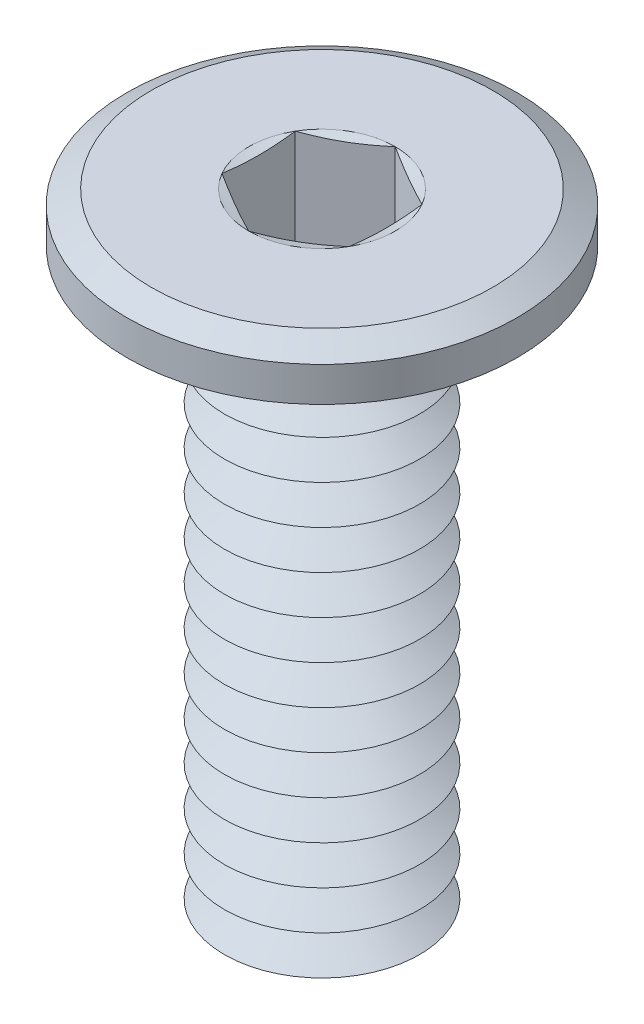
ISO-10303-21;
HEADER;
FILE_DESCRIPTION(('STEP AP214'),'2;1');
FILE_NAME('part.step','',(''),(''),'','','');
FILE_SCHEMA(('AUTOMOTIVE_DESIGN { 1 0 10303 214 1 1 1 1 }'));
ENDSEC;
DATA;
#1=APPLICATION_CONTEXT('core data for automotive mechanical design processes');
#2=APPLICATION_PROTOCOL_DEFINITION('international standard','automotive_design',2000,#1);
#3=PRODUCT_CONTEXT('',#1,'mechanical');
#4=PRODUCT('Part','Part','',(#3));
#5=PRODUCT_RELATED_PRODUCT_CATEGORY('part','',(#4));
#6=PRODUCT_DEFINITION_FORMATION('','',#4);
#7=PRODUCT_DEFINITION_CONTEXT('part definition',#1,'design');
#8=PRODUCT_DEFINITION('design','',#6,#7);
#9=PRODUCT_DEFINITION_SHAPE('','',#8);
#10=(LENGTH_UNIT() NAMED_UNIT(*) SI_UNIT(.MILLI.,.METRE.));
#11=(NAMED_UNIT(*) PLANE_ANGLE_UNIT() SI_UNIT($,.RADIAN.));
#12=(NAMED_UNIT(*) SI_UNIT($,.STERADIAN.) SOLID_ANGLE_UNIT());
#13=UNCERTAINTY_MEASURE_WITH_UNIT(LENGTH_MEASURE(1.E-05),#10,'distance_accuracy_value','');
#14=(GEOMETRIC_REPRESENTATION_CONTEXT(3) GLOBAL_UNCERTAINTY_ASSIGNED_CONTEXT((#13)) GLOBAL_UNIT_ASSIGNED_CONTEXT((#10,
#11,#12)) REPRESENTATION_CONTEXT('',''));
#15=CARTESIAN_POINT('',(0.,0.,0.));
#16=DIRECTION('',(0.,0.,1.));
#17=DIRECTION('',(1.,0.,0.));
#18=AXIS2_PLACEMENT_3D('',#15,#16,#17);
#19=CARTESIAN_POINT('',(0.,-5.9,0.));
#20=DIRECTION('',(0.,-1.,0.));
#21=DIRECTION('',(0.,0.,-1.));
#22=AXIS2_PLACEMENT_3D('',#19,#20,#21);
#23=CONICAL_SURFACE('',#22,1.,1.0471975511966);
#24=CARTESIAN_POINT('',(0.,-5.7,0.));
#25=DIRECTION('',(0.,1.,0.));
#26=DIRECTION('',(0.,0.,1.));
#27=AXIS2_PLACEMENT_3D('',#24,#25,#26);
#28=CIRCLE('',#27,0.653589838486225);
#29=CARTESIAN_POINT('',(0.,-5.7,0.653589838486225));
#30=VERTEX_POINT('',#29);
#31=EDGE_CURVE('E402',#30,#30,#28,.T.);
#32=ORIENTED_EDGE('',*,*,#31,.F.);
#33=EDGE_LOOP('',(#32));
#34=FACE_BOUND('',#33,.T.);
#35=CARTESIAN_POINT('',(0.,-5.9,0.));
#36=DIRECTION('',(0.,1.,0.));
#37=DIRECTION('',(0.,0.,1.));
#38=AXIS2_PLACEMENT_3D('',#35,#36,#37);
#39=CIRCLE('',#38,1.);
#40=CARTESIAN_POINT('',(0.,-5.9,1.));
#41=VERTEX_POINT('',#40);
#42=EDGE_CURVE('E405',#41,#41,#39,.T.);
#43=ORIENTED_EDGE('',*,*,#42,.T.);
#44=EDGE_LOOP('',(#43));
#45=FACE_BOUND('',#44,.T.);
#46=ADVANCED_FACE('F32',(#34,#45),#23,.T.);
#47=CARTESIAN_POINT('',(0.,-5.7,0.));
#48=DIRECTION('',(0.,1.,0.));
#49=DIRECTION('',(0.,0.,1.));
#50=AXIS2_PLACEMENT_3D('',#47,#48,#49);
#51=CONICAL_SURFACE('',#50,0.653589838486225,1.0471975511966);
#52=CARTESIAN_POINT('',(0.,-5.5,0.));
#53=DIRECTION('',(0.,1.,0.));
#54=DIRECTION('',(0.,0.,1.));
#55=AXIS2_PLACEMENT_3D('',#52,#53,#54);
#56=CIRCLE('',#55,1.);
#57=CARTESIAN_POINT('',(0.,-5.5,1.));
#58=VERTEX_POINT('',#57);
#59=EDGE_CURVE('E399',#58,#58,#56,.T.);
#60=ORIENTED_EDGE('',*,*,#59,.F.);
#61=EDGE_LOOP('',(#60));
#62=FACE_BOUND('',#61,.T.);
#63=ORIENTED_EDGE('',*,*,#31,.T.);
#64=EDGE_LOOP('',(#63));
#65=FACE_BOUND('',#64,.T.);
#66=ADVANCED_FACE('F215',(#62,#65),#51,.T.);
#67=CARTESIAN_POINT('',(0.,-6.5,0.));
#68=DIRECTION('',(0.,-1.,0.));
#69=DIRECTION('',(0.,0.,-1.));
#70=AXIS2_PLACEMENT_3D('',#67,#68,#69);
#71=PLANE('',#70);
#72=CARTESIAN_POINT('',(0.,-6.5,0.));
#73=DIRECTION('',(0.,1.,0.));
#74=DIRECTION('',(0.,0.,1.));
#75=AXIS2_PLACEMENT_3D('',#72,#73,#74);
#76=CIRCLE('',#75,0.653589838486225);
#77=CARTESIAN_POINT('',(0.,-6.5,0.653589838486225));
#78=VERTEX_POINT('',#77);
#79=EDGE_CURVE('E277',#78,#78,#76,.T.);
#80=ORIENTED_EDGE('',*,*,#79,.F.);
#81=EDGE_LOOP('',(#80));
#82=FACE_BOUND('',#81,.T.);
#83=ADVANCED_FACE('F221',(#82),#71,.T.);
#84=CARTESIAN_POINT('',(0.,-6.5,0.));
#85=DIRECTION('',(0.,1.,0.));
#86=DIRECTION('',(0.,0.,1.));
#87=AXIS2_PLACEMENT_3D('',#84,#85,#86);
#88=CONICAL_SURFACE('',#87,0.653589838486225,1.0471975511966);
#89=CARTESIAN_POINT('',(0.,-6.3,0.));
#90=DIRECTION('',(0.,1.,0.));
#91=DIRECTION('',(0.,0.,1.));
#92=AXIS2_PLACEMENT_3D('',#89,#90,#91);
#93=CIRCLE('',#92,1.);
#94=CARTESIAN_POINT('',(0.,-6.3,1.));
#95=VERTEX_POINT('',#94);
#96=EDGE_CURVE('E411',#95,#95,#93,.T.);
#97=ORIENTED_EDGE('',*,*,#96,.F.);
#98=EDGE_LOOP('',(#97));
#99=FACE_BOUND('',#98,.T.);
#100=ORIENTED_EDGE('',*,*,#79,.T.);
#101=EDGE_LOOP('',(#100));
#102=FACE_BOUND('',#101,.T.);
#103=ADVANCED_FACE('F236',(#99,#102),#88,.T.);
#104=CARTESIAN_POINT('',(0.,-6.3,0.));
#105=DIRECTION('',(0.,-1.,0.));
#106=DIRECTION('',(0.,0.,-1.));
#107=AXIS2_PLACEMENT_3D('',#104,#105,#106);
#108=CONICAL_SURFACE('',#107,1.,1.0471975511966);
#109=CARTESIAN_POINT('',(0.,-6.1,0.));
#110=DIRECTION('',(0.,1.,0.));
#111=DIRECTION('',(0.,0.,1.));
#112=AXIS2_PLACEMENT_3D('',#109,#110,#111);
#113=CIRCLE('',#112,0.653589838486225);
#114=CARTESIAN_POINT('',(0.,-6.1,0.653589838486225));
#115=VERTEX_POINT('',#114);
#116=EDGE_CURVE('E408',#115,#115,#113,.T.);
#117=ORIENTED_EDGE('',*,*,#116,.F.);
#118=EDGE_LOOP('',(#117));
#119=FACE_BOUND('',#118,.T.);
#120=ORIENTED_EDGE('',*,*,#96,.T.);
#121=EDGE_LOOP('',(#120));
#122=FACE_BOUND('',#121,.T.);
#123=ADVANCED_FACE('F232',(#119,#122),#108,.T.);
#124=CARTESIAN_POINT('',(0.,-6.1,0.));
#125=DIRECTION('',(0.,1.,0.));
#126=DIRECTION('',(0.,0.,1.));
#127=AXIS2_PLACEMENT_3D('',#124,#125,#126);
#128=CONICAL_SURFACE('',#127,0.653589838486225,1.0471975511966);
#129=ORIENTED_EDGE('',*,*,#42,.F.);
#130=EDGE_LOOP('',(#129));
#131=FACE_BOUND('',#130,.T.);
#132=ORIENTED_EDGE('',*,*,#116,.T.);
#133=EDGE_LOOP('',(#132));
#134=FACE_BOUND('',#133,.T.);
#135=ADVANCED_FACE('F228',(#131,#134),#128,.T.);
#136=CARTESIAN_POINT('',(0.,-5.5,0.));
#137=DIRECTION('',(0.,-1.,0.));
#138=DIRECTION('',(0.,0.,-1.));
#139=AXIS2_PLACEMENT_3D('',#136,#137,#138);
#140=CONICAL_SURFACE('',#139,1.,1.0471975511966);
#141=CARTESIAN_POINT('',(0.,-5.3,0.));
#142=DIRECTION('',(0.,1.,0.));
#143=DIRECTION('',(0.,0.,1.));
#144=AXIS2_PLACEMENT_3D('',#141,#142,#143);
#145=CIRCLE('',#144,0.653589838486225);
#146=CARTESIAN_POINT('',(0.,-5.3,0.653589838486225));
#147=VERTEX_POINT('',#146);
#148=EDGE_CURVE('E396',#147,#147,#145,.T.);
#149=ORIENTED_EDGE('',*,*,#148,.F.);
#150=EDGE_LOOP('',(#149));
#151=FACE_BOUND('',#150,.T.);
#152=ORIENTED_EDGE('',*,*,#59,.T.);
#153=EDGE_LOOP('',(#152));
#154=FACE_BOUND('',#153,.T.);
#155=ADVANCED_FACE('F231',(#151,#154),#140,.T.);
#156=CARTESIAN_POINT('',(0.,-5.3,0.));
#157=DIRECTION('',(0.,1.,0.));
#158=DIRECTION('',(0.,0.,1.));
#159=AXIS2_PLACEMENT_3D('',#156,#157,#158);
#160=CONICAL_SURFACE('',#159,0.653589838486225,1.0471975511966);
#161=CARTESIAN_POINT('',(0.,-5.1,0.));
#162=DIRECTION('',(0.,1.,0.));
#163=DIRECTION('',(0.,0.,1.));
#164=AXIS2_PLACEMENT_3D('',#161,#162,#163);
#165=CIRCLE('',#164,1.);
#166=CARTESIAN_POINT('',(0.,-5.1,1.));
#167=VERTEX_POINT('',#166);
#168=EDGE_CURVE('E393',#167,#167,#165,.T.);
#169=ORIENTED_EDGE('',*,*,#168,.F.);
#170=EDGE_LOOP('',(#169));
#171=FACE_BOUND('',#170,.T.);
#172=ORIENTED_EDGE('',*,*,#148,.T.);
#173=EDGE_LOOP('',(#172));
#174=FACE_BOUND('',#173,.T.);
#175=ADVANCED_FACE('F425',(#171,#174),#160,.T.);
#176=CARTESIAN_POINT('',(0.,-5.1,0.));
#177=DIRECTION('',(0.,-1.,0.));
#178=DIRECTION('',(0.,0.,-1.));
#179=AXIS2_PLACEMENT_3D('',#176,#177,#178);
#180=CONICAL_SURFACE('',#179,1.,1.0471975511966);
#181=CARTESIAN_POINT('',(0.,-4.9,0.));
#182=DIRECTION('',(0.,1.,0.));
#183=DIRECTION('',(0.,0.,1.));
#184=AXIS2_PLACEMENT_3D('',#181,#182,#183);
#185=CIRCLE('',#184,0.653589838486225);
#186=CARTESIAN_POINT('',(0.,-4.9,0.653589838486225));
#187=VERTEX_POINT('',#186);
#188=EDGE_CURVE('E390',#187,#187,#185,.T.);
#189=ORIENTED_EDGE('',*,*,#188,.F.);
#190=EDGE_LOOP('',(#189));
#191=FACE_BOUND('',#190,.T.);
#192=ORIENTED_EDGE('',*,*,#168,.T.);
#193=EDGE_LOOP('',(#192));
#194=FACE_BOUND('',#193,.T.);
#195=ADVANCED_FACE('F430',(#191,#194),#180,.T.);
#196=CARTESIAN_POINT('',(0.,-4.9,0.));
#197=DIRECTION('',(0.,1.,0.));
#198=DIRECTION('',(0.,0.,1.));
#199=AXIS2_PLACEMENT_3D('',#196,#197,#198);
#200=CONICAL_SURFACE('',#199,0.653589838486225,1.0471975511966);
#201=CARTESIAN_POINT('',(0.,-4.7,0.));
#202=DIRECTION('',(0.,1.,0.));
#203=DIRECTION('',(0.,0.,1.));
#204=AXIS2_PLACEMENT_3D('',#201,#202,#203);
#205=CIRCLE('',#204,1.);
#206=CARTESIAN_POINT('',(0.,-4.7,1.));
#207=VERTEX_POINT('',#206);
#208=EDGE_CURVE('E387',#207,#207,#205,.T.);
#209=ORIENTED_EDGE('',*,*,#208,.F.);
#210=EDGE_LOOP('',(#209));
#211=FACE_BOUND('',#210,.T.);
#212=ORIENTED_EDGE('',*,*,#188,.T.);
#213=EDGE_LOOP('',(#212));
#214=FACE_BOUND('',#213,.T.);
#215=ADVANCED_FACE('F437',(#211,#214),#200,.T.);
#216=CARTESIAN_POINT('',(0.,-4.7,0.));
#217=DIRECTION('',(0.,-1.,0.));
#218=DIRECTION('',(0.,0.,-1.));
#219=AXIS2_PLACEMENT_3D('',#216,#217,#218);
#220=CONICAL_SURFACE('',#219,1.,1.0471975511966);
#221=CARTESIAN_POINT('',(0.,-4.5,0.));
#222=DIRECTION('',(0.,1.,0.));
#223=DIRECTION('',(0.,0.,1.));
#224=AXIS2_PLACEMENT_3D('',#221,#222,#223);
#225=CIRCLE('',#224,0.653589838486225);
#226=CARTESIAN_POINT('',(0.,-4.5,0.653589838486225));
#227=VERTEX_POINT('',#226);
#228=EDGE_CURVE('E384',#227,#227,#225,.T.);
#229=ORIENTED_EDGE('',*,*,#228,.F.);
#230=EDGE_LOOP('',(#229));
#231=FACE_BOUND('',#230,.T.);
#232=ORIENTED_EDGE('',*,*,#208,.T.);
#233=EDGE_LOOP('',(#232));
#234=FACE_BOUND('',#233,.T.);
#235=ADVANCED_FACE('F441',(#231,#234),#220,.T.);
#236=CARTESIAN_POINT('',(0.,-4.5,0.));
#237=DIRECTION('',(0.,1.,0.));
#238=DIRECTION('',(0.,0.,1.));
#239=AXIS2_PLACEMENT_3D('',#236,#237,#238);
#240=CONICAL_SURFACE('',#239,0.653589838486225,1.0471975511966);
#241=CARTESIAN_POINT('',(0.,-4.3,0.));
#242=DIRECTION('',(0.,1.,0.));
#243=DIRECTION('',(0.,0.,1.));
#244=AXIS2_PLACEMENT_3D('',#241,#242,#243);
#245=CIRCLE('',#244,1.);
#246=CARTESIAN_POINT('',(0.,-4.3,1.));
#247=VERTEX_POINT('',#246);
#248=EDGE_CURVE('E381',#247,#247,#245,.T.);
#249=ORIENTED_EDGE('',*,*,#248,.F.);
#250=EDGE_LOOP('',(#249));
#251=FACE_BOUND('',#250,.T.);
#252=ORIENTED_EDGE('',*,*,#228,.T.);
#253=EDGE_LOOP('',(#252));
#254=FACE_BOUND('',#253,.T.);
#255=ADVANCED_FACE('F445',(#251,#254),#240,.T.);
#256=CARTESIAN_POINT('',(0.,-4.3,0.));
#257=DIRECTION('',(0.,-1.,0.));
#258=DIRECTION('',(0.,0.,-1.));
#259=AXIS2_PLACEMENT_3D('',#256,#257,#258);
#260=CONICAL_SURFACE('',#259,1.,1.0471975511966);
#261=CARTESIAN_POINT('',(0.,-4.1,0.));
#262=DIRECTION('',(0.,1.,0.));
#263=DIRECTION('',(0.,0.,1.));
#264=AXIS2_PLACEMENT_3D('',#261,#262,#263);
#265=CIRCLE('',#264,0.653589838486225);
#266=CARTESIAN_POINT('',(0.,-4.1,0.653589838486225));
#267=VERTEX_POINT('',#266);
#268=EDGE_CURVE('E378',#267,#267,#265,.T.);
#269=ORIENTED_EDGE('',*,*,#268,.F.);
#270=EDGE_LOOP('',(#269));
#271=FACE_BOUND('',#270,.T.);
#272=ORIENTED_EDGE('',*,*,#248,.T.);
#273=EDGE_LOOP('',(#272));
#274=FACE_BOUND('',#273,.T.);
#275=ADVANCED_FACE('F449',(#271,#274),#260,.T.);
#276=CARTESIAN_POINT('',(0.,-4.1,0.));
#277=DIRECTION('',(0.,1.,0.));
#278=DIRECTION('',(0.,0.,1.));
#279=AXIS2_PLACEMENT_3D('',#276,#277,#278);
#280=CONICAL_SURFACE('',#279,0.653589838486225,1.0471975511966);
#281=CARTESIAN_POINT('',(0.,-3.9,0.));
#282=DIRECTION('',(0.,1.,0.));
#283=DIRECTION('',(0.,0.,1.));
#284=AXIS2_PLACEMENT_3D('',#281,#282,#283);
#285=CIRCLE('',#284,1.);
#286=CARTESIAN_POINT('',(0.,-3.9,1.));
#287=VERTEX_POINT('',#286);
#288=EDGE_CURVE('E375',#287,#287,#285,.T.);
#289=ORIENTED_EDGE('',*,*,#288,.F.);
#290=EDGE_LOOP('',(#289));
#291=FACE_BOUND('',#290,.T.);
#292=ORIENTED_EDGE('',*,*,#268,.T.);
#293=EDGE_LOOP('',(#292));
#294=FACE_BOUND('',#293,.T.);
#295=ADVANCED_FACE('F453',(#291,#294),#280,.T.);
#296=CARTESIAN_POINT('',(0.,-3.9,0.));
#297=DIRECTION('',(0.,-1.,0.));
#298=DIRECTION('',(0.,0.,-1.));
#299=AXIS2_PLACEMENT_3D('',#296,#297,#298);
#300=CONICAL_SURFACE('',#299,1.,1.0471975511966);
#301=CARTESIAN_POINT('',(0.,-3.7,0.));
#302=DIRECTION('',(0.,1.,0.));
#303=DIRECTION('',(0.,0.,1.));
#304=AXIS2_PLACEMENT_3D('',#301,#302,#303);
#305=CIRCLE('',#304,0.653589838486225);
#306=CARTESIAN_POINT('',(0.,-3.7,0.653589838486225));
#307=VERTEX_POINT('',#306);
#308=EDGE_CURVE('E372',#307,#307,#305,.T.);
#309=ORIENTED_EDGE('',*,*,#308,.F.);
#310=EDGE_LOOP('',(#309));
#311=FACE_BOUND('',#310,.T.);
#312=ORIENTED_EDGE('',*,*,#288,.T.);
#313=EDGE_LOOP('',(#312));
#314=FACE_BOUND('',#313,.T.);
#315=ADVANCED_FACE('F457',(#311,#314),#300,.T.);
#316=CARTESIAN_POINT('',(0.,-3.7,0.));
#317=DIRECTION('',(0.,1.,0.));
#318=DIRECTION('',(0.,0.,1.));
#319=AXIS2_PLACEMENT_3D('',#316,#317,#318);
#320=CONICAL_SURFACE('',#319,0.653589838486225,1.0471975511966);
#321=CARTESIAN_POINT('',(0.,-3.5,0.));
#322=DIRECTION('',(0.,1.,0.));
#323=DIRECTION('',(0.,0.,1.));
#324=AXIS2_PLACEMENT_3D('',#321,#322,#323);
#325=CIRCLE('',#324,1.);
#326=CARTESIAN_POINT('',(0.,-3.5,1.));
#327=VERTEX_POINT('',#326);
#328=EDGE_CURVE('E369',#327,#327,#325,.T.);
#329=ORIENTED_EDGE('',*,*,#328,.F.);
#330=EDGE_LOOP('',(#329));
#331=FACE_BOUND('',#330,.T.);
#332=ORIENTED_EDGE('',*,*,#308,.T.);
#333=EDGE_LOOP('',(#332));
#334=FACE_BOUND('',#333,.T.);
#335=ADVANCED_FACE('F461',(#331,#334),#320,.T.);
#336=CARTESIAN_POINT('',(0.,-3.5,0.));
#337=DIRECTION('',(0.,-1.,0.));
#338=DIRECTION('',(0.,0.,-1.));
#339=AXIS2_PLACEMENT_3D('',#336,#337,#338);
#340=CONICAL_SURFACE('',#339,1.,1.0471975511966);
#341=CARTESIAN_POINT('',(0.,-3.3,0.));
#342=DIRECTION('',(0.,1.,0.));
#343=DIRECTION('',(0.,0.,1.));
#344=AXIS2_PLACEMENT_3D('',#341,#342,#343);
#345=CIRCLE('',#344,0.653589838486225);
#346=CARTESIAN_POINT('',(0.,-3.3,0.653589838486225));
#347=VERTEX_POINT('',#346);
#348=EDGE_CURVE('E366',#347,#347,#345,.T.);
#349=ORIENTED_EDGE('',*,*,#348,.F.);
#350=EDGE_LOOP('',(#349));
#351=FACE_BOUND('',#350,.T.);
#352=ORIENTED_EDGE('',*,*,#328,.T.);
#353=EDGE_LOOP('',(#352));
#354=FACE_BOUND('',#353,.T.);
#355=ADVANCED_FACE('F465',(#351,#354),#340,.T.);
#356=CARTESIAN_POINT('',(0.,-3.3,0.));
#357=DIRECTION('',(0.,1.,0.));
#358=DIRECTION('',(0.,0.,1.));
#359=AXIS2_PLACEMENT_3D('',#356,#357,#358);
#360=CONICAL_SURFACE('',#359,0.653589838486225,1.0471975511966);
#361=CARTESIAN_POINT('',(0.,-3.1,0.));
#362=DIRECTION('',(0.,1.,0.));
#363=DIRECTION('',(0.,0.,1.));
#364=AXIS2_PLACEMENT_3D('',#361,#362,#363);
#365=CIRCLE('',#364,1.);
#366=CARTESIAN_POINT('',(0.,-3.1,1.));
#367=VERTEX_POINT('',#366);
#368=EDGE_CURVE('E363',#367,#367,#365,.T.);
#369=ORIENTED_EDGE('',*,*,#368,.F.);
#370=EDGE_LOOP('',(#369));
#371=FACE_BOUND('',#370,.T.);
#372=ORIENTED_EDGE('',*,*,#348,.T.);
#373=EDGE_LOOP('',(#372));
#374=FACE_BOUND('',#373,.T.);
#375=ADVANCED_FACE('F469',(#371,#374),#360,.T.);
#376=CARTESIAN_POINT('',(0.,-3.1,0.));
#377=DIRECTION('',(0.,-1.,0.));
#378=DIRECTION('',(0.,0.,-1.));
#379=AXIS2_PLACEMENT_3D('',#376,#377,#378);
#380=CONICAL_SURFACE('',#379,1.,1.0471975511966);
#381=CARTESIAN_POINT('',(0.,-2.9,0.));
#382=DIRECTION('',(0.,1.,0.));
#383=DIRECTION('',(0.,0.,1.));
#384=AXIS2_PLACEMENT_3D('',#381,#382,#383);
#385=CIRCLE('',#384,0.653589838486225);
#386=CARTESIAN_POINT('',(0.,-2.9,0.653589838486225));
#387=VERTEX_POINT('',#386);
#388=EDGE_CURVE('E360',#387,#387,#385,.T.);
#389=ORIENTED_EDGE('',*,*,#388,.F.);
#390=EDGE_LOOP('',(#389));
#391=FACE_BOUND('',#390,.T.);
#392=ORIENTED_EDGE('',*,*,#368,.T.);
#393=EDGE_LOOP('',(#392));
#394=FACE_BOUND('',#393,.T.);
#395=ADVANCED_FACE('F473',(#391,#394),#380,.T.);
#396=CARTESIAN_POINT('',(0.,-2.9,0.));
#397=DIRECTION('',(0.,1.,0.));
#398=DIRECTION('',(0.,0.,1.));
#399=AXIS2_PLACEMENT_3D('',#396,#397,#398);
#400=CONICAL_SURFACE('',#399,0.653589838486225,1.0471975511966);
#401=CARTESIAN_POINT('',(0.,-2.7,0.));
#402=DIRECTION('',(0.,1.,0.));
#403=DIRECTION('',(0.,0.,1.));
#404=AXIS2_PLACEMENT_3D('',#401,#402,#403);
#405=CIRCLE('',#404,1.);
#406=CARTESIAN_POINT('',(0.,-2.7,1.));
#407=VERTEX_POINT('',#406);
#408=EDGE_CURVE('E357',#407,#407,#405,.T.);
#409=ORIENTED_EDGE('',*,*,#408,.F.);
#410=EDGE_LOOP('',(#409));
#411=FACE_BOUND('',#410,.T.);
#412=ORIENTED_EDGE('',*,*,#388,.T.);
#413=EDGE_LOOP('',(#412));
#414=FACE_BOUND('',#413,.T.);
#415=ADVANCED_FACE('F477',(#411,#414),#400,.T.);
#416=CARTESIAN_POINT('',(0.,-2.7,0.));
#417=DIRECTION('',(0.,-1.,0.));
#418=DIRECTION('',(0.,0.,-1.));
#419=AXIS2_PLACEMENT_3D('',#416,#417,#418);
#420=CONICAL_SURFACE('',#419,1.,1.0471975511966);
#421=CARTESIAN_POINT('',(0.,-2.5,0.));
#422=DIRECTION('',(0.,1.,0.));
#423=DIRECTION('',(0.,0.,1.));
#424=AXIS2_PLACEMENT_3D('',#421,#422,#423);
#425=CIRCLE('',#424,0.653589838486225);
#426=CARTESIAN_POINT('',(0.,-2.5,0.653589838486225));
#427=VERTEX_POINT('',#426);
#428=EDGE_CURVE('E354',#427,#427,#425,.T.);
#429=ORIENTED_EDGE('',*,*,#428,.F.);
#430=EDGE_LOOP('',(#429));
#431=FACE_BOUND('',#430,.T.);
#432=ORIENTED_EDGE('',*,*,#408,.T.);
#433=EDGE_LOOP('',(#432));
#434=FACE_BOUND('',#433,.T.);
#435=ADVANCED_FACE('F481',(#431,#434),#420,.T.);
#436=CARTESIAN_POINT('',(0.,-2.5,0.));
#437=DIRECTION('',(0.,1.,0.));
#438=DIRECTION('',(0.,0.,1.));
#439=AXIS2_PLACEMENT_3D('',#436,#437,#438);
#440=CONICAL_SURFACE('',#439,0.653589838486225,1.0471975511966);
#441=CARTESIAN_POINT('',(0.,-2.3,0.));
#442=DIRECTION('',(0.,1.,0.));
#443=DIRECTION('',(0.,0.,1.));
#444=AXIS2_PLACEMENT_3D('',#441,#442,#443);
#445=CIRCLE('',#444,1.);
#446=CARTESIAN_POINT('',(0.,-2.3,1.));
#447=VERTEX_POINT('',#446);
#448=EDGE_CURVE('E351',#447,#447,#445,.T.);
#449=ORIENTED_EDGE('',*,*,#448,.F.);
#450=EDGE_LOOP('',(#449));
#451=FACE_BOUND('',#450,.T.);
#452=ORIENTED_EDGE('',*,*,#428,.T.);
#453=EDGE_LOOP('',(#452));
#454=FACE_BOUND('',#453,.T.);
#455=ADVANCED_FACE('F485',(#451,#454),#440,.T.);
#456=CARTESIAN_POINT('',(0.,-2.3,0.));
#457=DIRECTION('',(0.,-1.,0.));
#458=DIRECTION('',(0.,0.,-1.));
#459=AXIS2_PLACEMENT_3D('',#456,#457,#458);
#460=CONICAL_SURFACE('',#459,1.,1.0471975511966);
#461=CARTESIAN_POINT('',(0.,-2.1,0.));
#462=DIRECTION('',(0.,1.,0.));
#463=DIRECTION('',(0.,0.,1.));
#464=AXIS2_PLACEMENT_3D('',#461,#462,#463);
#465=CIRCLE('',#464,0.653589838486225);
#466=CARTESIAN_POINT('',(0.,-2.1,0.653589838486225));
#467=VERTEX_POINT('',#466);
#468=EDGE_CURVE('E348',#467,#467,#465,.T.);
#469=ORIENTED_EDGE('',*,*,#468,.F.);
#470=EDGE_LOOP('',(#469));
#471=FACE_BOUND('',#470,.T.);
#472=ORIENTED_EDGE('',*,*,#448,.T.);
#473=EDGE_LOOP('',(#472));
#474=FACE_BOUND('',#473,.T.);
#475=ADVANCED_FACE('F489',(#471,#474),#460,.T.);
#476=CARTESIAN_POINT('',(0.,-2.1,0.));
#477=DIRECTION('',(0.,1.,0.));
#478=DIRECTION('',(0.,0.,1.));
#479=AXIS2_PLACEMENT_3D('',#476,#477,#478);
#480=CONICAL_SURFACE('',#479,0.653589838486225,1.0471975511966);
#481=CARTESIAN_POINT('',(0.,-1.9,0.));
#482=DIRECTION('',(0.,1.,0.));
#483=DIRECTION('',(0.,0.,1.));
#484=AXIS2_PLACEMENT_3D('',#481,#482,#483);
#485=CIRCLE('',#484,1.);
#486=CARTESIAN_POINT('',(0.,-1.9,1.));
#487=VERTEX_POINT('',#486);
#488=EDGE_CURVE('E345',#487,#487,#485,.T.);
#489=ORIENTED_EDGE('',*,*,#488,.F.);
#490=EDGE_LOOP('',(#489));
#491=FACE_BOUND('',#490,.T.);
#492=ORIENTED_EDGE('',*,*,#468,.T.);
#493=EDGE_LOOP('',(#492));
#494=FACE_BOUND('',#493,.T.);
#495=ADVANCED_FACE('F493',(#491,#494),#480,.T.);
#496=CARTESIAN_POINT('',(0.,-1.9,0.));
#497=DIRECTION('',(0.,-1.,0.));
#498=DIRECTION('',(0.,0.,-1.));
#499=AXIS2_PLACEMENT_3D('',#496,#497,#498);
#500=CONICAL_SURFACE('',#499,1.,1.0471975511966);
#501=CARTESIAN_POINT('',(0.,-1.7,0.));
#502=DIRECTION('',(0.,1.,0.));
#503=DIRECTION('',(0.,0.,1.));
#504=AXIS2_PLACEMENT_3D('',#501,#502,#503);
#505=CIRCLE('',#504,0.653589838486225);
#506=CARTESIAN_POINT('',(0.,-1.7,0.653589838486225));
#507=VERTEX_POINT('',#506);
#508=EDGE_CURVE('E342',#507,#507,#505,.T.);
#509=ORIENTED_EDGE('',*,*,#508,.F.);
#510=EDGE_LOOP('',(#509));
#511=FACE_BOUND('',#510,.T.);
#512=ORIENTED_EDGE('',*,*,#488,.T.);
#513=EDGE_LOOP('',(#512));
#514=FACE_BOUND('',#513,.T.);
#515=ADVANCED_FACE('F497',(#511,#514),#500,.T.);
#516=CARTESIAN_POINT('',(0.,-1.7,0.));
#517=DIRECTION('',(0.,1.,0.));
#518=DIRECTION('',(0.,0.,1.));
#519=AXIS2_PLACEMENT_3D('',#516,#517,#518);
#520=CONICAL_SURFACE('',#519,0.653589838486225,1.0471975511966);
#521=CARTESIAN_POINT('',(0.,-1.5,0.));
#522=DIRECTION('',(0.,1.,0.));
#523=DIRECTION('',(0.,0.,1.));
#524=AXIS2_PLACEMENT_3D('',#521,#522,#523);
#525=CIRCLE('',#524,1.);
#526=CARTESIAN_POINT('',(0.,-1.5,1.));
#527=VERTEX_POINT('',#526);
#528=EDGE_CURVE('E339',#527,#527,#525,.T.);
#529=ORIENTED_EDGE('',*,*,#528,.F.);
#530=EDGE_LOOP('',(#529));
#531=FACE_BOUND('',#530,.T.);
#532=ORIENTED_EDGE('',*,*,#508,.T.);
#533=EDGE_LOOP('',(#532));
#534=FACE_BOUND('',#533,.T.);
#535=ADVANCED_FACE('F501',(#531,#534),#520,.T.);
#536=CARTESIAN_POINT('',(0.,-1.5,0.));
#537=DIRECTION('',(0.,-1.,0.));
#538=DIRECTION('',(0.,0.,-1.));
#539=AXIS2_PLACEMENT_3D('',#536,#537,#538);
#540=CONICAL_SURFACE('',#539,1.,1.0471975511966);
#541=CARTESIAN_POINT('',(0.,-1.3,0.));
#542=DIRECTION('',(0.,1.,0.));
#543=DIRECTION('',(0.,0.,1.));
#544=AXIS2_PLACEMENT_3D('',#541,#542,#543);
#545=CIRCLE('',#544,0.653589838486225);
#546=CARTESIAN_POINT('',(0.,-1.3,0.653589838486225));
#547=VERTEX_POINT('',#546);
#548=EDGE_CURVE('E336',#547,#547,#545,.T.);
#549=ORIENTED_EDGE('',*,*,#548,.F.);
#550=EDGE_LOOP('',(#549));
#551=FACE_BOUND('',#550,.T.);
#552=ORIENTED_EDGE('',*,*,#528,.T.);
#553=EDGE_LOOP('',(#552));
#554=FACE_BOUND('',#553,.T.);
#555=ADVANCED_FACE('F505',(#551,#554),#540,.T.);
#556=CARTESIAN_POINT('',(0.,-1.3,0.));
#557=DIRECTION('',(0.,1.,0.));
#558=DIRECTION('',(0.,0.,1.));
#559=AXIS2_PLACEMENT_3D('',#556,#557,#558);
#560=CONICAL_SURFACE('',#559,0.653589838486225,1.0471975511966);
#561=CARTESIAN_POINT('',(0.,-1.1,0.));
#562=DIRECTION('',(0.,1.,0.));
#563=DIRECTION('',(0.,0.,1.));
#564=AXIS2_PLACEMENT_3D('',#561,#562,#563);
#565=CIRCLE('',#564,1.);
#566=CARTESIAN_POINT('',(0.,-1.1,1.));
#567=VERTEX_POINT('',#566);
#568=EDGE_CURVE('E325',#567,#567,#565,.T.);
#569=ORIENTED_EDGE('',*,*,#568,.F.);
#570=EDGE_LOOP('',(#569));
#571=FACE_BOUND('',#570,.T.);
#572=ORIENTED_EDGE('',*,*,#548,.T.);
#573=EDGE_LOOP('',(#572));
#574=FACE_BOUND('',#573,.T.);
#575=ADVANCED_FACE('F256',(#571,#574),#560,.T.);
#576=CARTESIAN_POINT('',(0.,0.,0.));
#577=DIRECTION('',(0.,1.,0.));
#578=DIRECTION('',(0.,0.,1.));
#579=AXIS2_PLACEMENT_3D('',#576,#577,#578);
#580=PLANE('',#579);
#581=CARTESIAN_POINT('',(0.,0.,0.));
#582=DIRECTION('',(0.,1.,0.));
#583=DIRECTION('',(0.,0.,1.));
#584=AXIS2_PLACEMENT_3D('',#581,#582,#583);
#585=CIRCLE('',#584,0.750555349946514);
#586=CARTESIAN_POINT('',(0.,0.,0.750555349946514));
#587=VERTEX_POINT('',#586);
#588=CARTESIAN_POINT('',(0.65,0.,0.375277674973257));
#589=VERTEX_POINT('',#588);
#590=EDGE_CURVE('E58',#587,#589,#585,.T.);
#591=ORIENTED_EDGE('',*,*,#590,.F.);
#592=CARTESIAN_POINT('',(-0.65,0.,0.375277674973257));
#593=VERTEX_POINT('',#592);
#594=EDGE_CURVE('E154',#593,#587,#585,.T.);
#595=ORIENTED_EDGE('',*,*,#594,.F.);
#596=CARTESIAN_POINT('',(-0.65,0.,-0.375277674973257));
#597=VERTEX_POINT('',#596);
#598=EDGE_CURVE('E153',#597,#593,#585,.T.);
#599=ORIENTED_EDGE('',*,*,#598,.F.);
#600=CARTESIAN_POINT('',(0.,0.,-0.750555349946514));
#601=VERTEX_POINT('',#600);
#602=EDGE_CURVE('E119',#601,#597,#585,.T.);
#603=ORIENTED_EDGE('',*,*,#602,.F.);
#604=CARTESIAN_POINT('',(0.65,0.,-0.375277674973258));
#605=VERTEX_POINT('',#604);
#606=EDGE_CURVE('E111',#605,#601,#585,.T.);
#607=ORIENTED_EDGE('',*,*,#606,.F.);
#608=EDGE_CURVE('E51',#589,#605,#585,.T.);
#609=ORIENTED_EDGE('',*,*,#608,.F.);
#610=EDGE_LOOP('',(#591,#595,#599,#603,#607,#609));
#611=FACE_BOUND('',#610,.T.);
#612=CARTESIAN_POINT('',(0.,0.,0.));
#613=DIRECTION('',(0.,1.,0.));
#614=DIRECTION('',(0.,0.,1.));
#615=AXIS2_PLACEMENT_3D('',#612,#613,#614);
#616=CIRCLE('',#615,1.75);
#617=CARTESIAN_POINT('',(0.,0.,1.75));
#618=VERTEX_POINT('',#617);
#619=EDGE_CURVE('E274',#618,#618,#616,.T.);
#620=ORIENTED_EDGE('',*,*,#619,.T.);
#621=EDGE_LOOP('',(#620));
#622=FACE_BOUND('',#621,.T.);
#623=ADVANCED_FACE('F149',(#611,#622),#580,.T.);
#624=CARTESIAN_POINT('',(0.,-0.5,0.));
#625=DIRECTION('',(0.,1.,0.));
#626=DIRECTION('',(0.,0.,1.));
#627=AXIS2_PLACEMENT_3D('',#624,#625,#626);
#628=CYLINDRICAL_SURFACE('',#627,2.);
#629=CARTESIAN_POINT('',(0.,-0.144337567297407,0.));
#630=DIRECTION('',(0.,1.,0.));
#631=DIRECTION('',(0.,0.,1.));
#632=AXIS2_PLACEMENT_3D('',#629,#630,#631);
#633=CIRCLE('',#632,2.);
#634=CARTESIAN_POINT('',(0.,-0.144337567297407,2.));
#635=VERTEX_POINT('',#634);
#636=EDGE_CURVE('E283',#635,#635,#633,.F.);
#637=ORIENTED_EDGE('',*,*,#636,.T.);
#638=EDGE_LOOP('',(#637));
#639=FACE_BOUND('',#638,.T.);
#640=CARTESIAN_POINT('',(0.,-0.5,0.));
#641=DIRECTION('',(0.,1.,0.));
#642=DIRECTION('',(0.,0.,1.));
#643=AXIS2_PLACEMENT_3D('',#640,#641,#642);
#644=CIRCLE('',#643,2.);
#645=CARTESIAN_POINT('',(0.,-0.5,2.));
#646=VERTEX_POINT('',#645);
#647=EDGE_CURVE('E272',#646,#646,#644,.T.);
#648=ORIENTED_EDGE('',*,*,#647,.T.);
#649=EDGE_LOOP('',(#648));
#650=FACE_BOUND('',#649,.T.);
#651=ADVANCED_FACE('F252',(#639,#650),#628,.T.);
#652=CARTESIAN_POINT('',(0.,-0.5,0.));
#653=DIRECTION('',(0.,1.,0.));
#654=DIRECTION('',(0.,0.,1.));
#655=AXIS2_PLACEMENT_3D('',#652,#653,#654);
#656=PLANE('',#655);
#657=CARTESIAN_POINT('',(0.,-0.5,0.));
#658=DIRECTION('',(0.,1.,0.));
#659=DIRECTION('',(0.,0.,1.));
#660=AXIS2_PLACEMENT_3D('',#657,#658,#659);
#661=CIRCLE('',#660,1.1);
#662=CARTESIAN_POINT('',(0.,-0.5,1.1));
#663=VERTEX_POINT('',#662);
#664=EDGE_CURVE('E268',#663,#663,#661,.T.);
#665=ORIENTED_EDGE('',*,*,#664,.T.);
#666=EDGE_LOOP('',(#665));
#667=FACE_BOUND('',#666,.T.);
#668=ORIENTED_EDGE('',*,*,#647,.F.);
#669=EDGE_LOOP('',(#668));
#670=FACE_BOUND('',#669,.T.);
#671=ADVANCED_FACE('F248',(#667,#670),#656,.F.);
#672=CARTESIAN_POINT('',(0.,-6.5,0.));
#673=DIRECTION('',(0.,1.,0.));
#674=DIRECTION('',(0.,0.,1.));
#675=AXIS2_PLACEMENT_3D('',#672,#673,#674);
#676=CYLINDRICAL_SURFACE('',#675,1.);
#677=CARTESIAN_POINT('',(0.,-0.6,0.));
#678=DIRECTION('',(0.,1.,0.));
#679=DIRECTION('',(0.,0.,1.));
#680=AXIS2_PLACEMENT_3D('',#677,#678,#679);
#681=CIRCLE('',#680,1.);
#682=CARTESIAN_POINT('',(0.,-0.6,1.));
#683=VERTEX_POINT('',#682);
#684=EDGE_CURVE('E271',#683,#683,#681,.F.);
#685=ORIENTED_EDGE('',*,*,#684,.T.);
#686=EDGE_LOOP('',(#685));
#687=FACE_BOUND('',#686,.T.);
#688=ORIENTED_EDGE('',*,*,#568,.T.);
#689=EDGE_LOOP('',(#688));
#690=FACE_BOUND('',#689,.T.);
#691=ADVANCED_FACE('F244',(#687,#690),#676,.T.);
#692=CARTESIAN_POINT('',(0.,-0.6,0.));
#693=DIRECTION('',(0.,1.,0.));
#694=DIRECTION('',(0.,0.,1.));
#695=AXIS2_PLACEMENT_3D('',#692,#693,#694);
#696=TOROIDAL_SURFACE('',#695,1.1,0.1);
#697=ORIENTED_EDGE('',*,*,#664,.F.);
#698=EDGE_LOOP('',(#697));
#699=FACE_BOUND('',#698,.T.);
#700=ORIENTED_EDGE('',*,*,#684,.F.);
#701=EDGE_LOOP('',(#700));
#702=FACE_BOUND('',#701,.T.);
#703=ADVANCED_FACE('F247',(#699,#702),#696,.F.);
#704=CARTESIAN_POINT('',(0.,0.,0.));
#705=DIRECTION('',(0.,-1.,0.));
#706=DIRECTION('',(0.,0.,-1.));
#707=AXIS2_PLACEMENT_3D('',#704,#705,#706);
#708=CONICAL_SURFACE('',#707,1.75,1.0471975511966);
#709=ORIENTED_EDGE('',*,*,#636,.F.);
#710=EDGE_LOOP('',(#709));
#711=FACE_BOUND('',#710,.T.);
#712=ORIENTED_EDGE('',*,*,#619,.F.);
#713=EDGE_LOOP('',(#712));
#714=FACE_BOUND('',#713,.T.);
#715=ADVANCED_FACE('F34',(#711,#714),#708,.T.);
#716=CARTESIAN_POINT('',(0.,0.,0.));
#717=DIRECTION('',(0.,1.,0.));
#718=DIRECTION('',(0.,0.,1.));
#719=AXIS2_PLACEMENT_3D('',#716,#717,#718);
#720=CONICAL_SURFACE('',#719,0.750555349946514,1.30899693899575);
#721=ORIENTED_EDGE('',*,*,#602,.T.);
#722=CARTESIAN_POINT('',(0.000200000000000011,3.09472466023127E-05,-0.750670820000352));
#723=CARTESIAN_POINT('',(-0.0268094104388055,-0.00415092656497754,-0.735076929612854));
#724=CARTESIAN_POINT('',(-0.0538678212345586,-0.00794750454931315,-0.719454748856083));
#725=CARTESIAN_POINT('',(-0.108080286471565,-0.0146178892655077,-0.688155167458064));
#726=CARTESIAN_POINT('',(-0.135234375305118,-0.0174913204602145,-0.672477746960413));
#727=CARTESIAN_POINT('',(-0.18947340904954,-0.0221475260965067,-0.641162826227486));
#728=CARTESIAN_POINT('',(-0.216557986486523,-0.0239358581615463,-0.625525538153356));
#729=CARTESIAN_POINT('',(-0.270761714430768,-0.0263338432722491,-0.594231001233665));
#730=CARTESIAN_POINT('',(-0.297880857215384,-0.0269437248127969,-0.578573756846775));
#731=CARTESIAN_POINT('',(-0.352119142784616,-0.0269437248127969,-0.547259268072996));
#732=CARTESIAN_POINT('',(-0.379238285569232,-0.0263338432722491,-0.531602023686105));
#733=CARTESIAN_POINT('',(-0.433442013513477,-0.0239358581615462,-0.500307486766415));
#734=CARTESIAN_POINT('',(-0.460526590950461,-0.0221475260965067,-0.484670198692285));
#735=CARTESIAN_POINT('',(-0.514765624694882,-0.0174913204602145,-0.453355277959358));
#736=CARTESIAN_POINT('',(-0.541919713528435,-0.0146178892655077,-0.437677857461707));
#737=CARTESIAN_POINT('',(-0.596132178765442,-0.00794750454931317,-0.406378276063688));
#738=CARTESIAN_POINT('',(-0.623190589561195,-0.00415092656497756,-0.390756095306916));
#739=CARTESIAN_POINT('',(-0.6502,3.09472466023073E-05,-0.375162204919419));
#740=B_SPLINE_CURVE_WITH_KNOTS('',3,(#722,#723,#724,#725,#726,#727,#728,#729,#730,#731,#732,
#733,#734,#735,#736,#737,#738,#739),.UNSPECIFIED.,.F.,.F.,(4,2,2,2,2,2,2,2,4),(0.,
0.0944056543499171,0.188849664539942,0.282805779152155,0.376743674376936,0.470681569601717,
0.564637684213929,0.659081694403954,0.753487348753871),.UNSPECIFIED.);
#741=EDGE_CURVE('E11',#601,#597,#740,.T.);
#742=ORIENTED_EDGE('',*,*,#741,.F.);
#743=EDGE_LOOP('',(#721,#742));
#744=FACE_BOUND('',#743,.T.);
#745=ADVANCED_FACE('F123',(#744),#720,.F.);
#746=ORIENTED_EDGE('',*,*,#598,.T.);
#747=CARTESIAN_POINT('',(-0.65,0.153431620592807,-1.15250975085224));
#748=CARTESIAN_POINT('',(-0.65,0.140485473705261,-1.09696292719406));
#749=CARTESIAN_POINT('',(-0.65,0.12772104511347,-1.04137089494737));
#750=CARTESIAN_POINT('',(-0.65,0.102806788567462,-0.93003898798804));
#751=CARTESIAN_POINT('',(-0.65,0.0906570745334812,-0.874299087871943));
#752=CARTESIAN_POINT('',(-0.65,0.0671143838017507,-0.762091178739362));
#753=CARTESIAN_POINT('',(-0.65,0.0557299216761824,-0.70562136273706));
#754=CARTESIAN_POINT('',(-0.65,0.0342960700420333,-0.59241870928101));
#755=CARTESIAN_POINT('',(-0.65,0.0242468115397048,-0.535685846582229));
#756=CARTESIAN_POINT('',(-0.65,0.00641278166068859,-0.423455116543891));
#757=CARTESIAN_POINT('',(-0.65,-0.00142665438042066,-0.367966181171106));
#758=CARTESIAN_POINT('',(-0.65,-0.0143371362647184,-0.256669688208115));
#759=CARTESIAN_POINT('',(-0.65,-0.0194090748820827,-0.200862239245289));
#760=CARTESIAN_POINT('',(-0.65,-0.025908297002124,-0.0892782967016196));
#761=CARTESIAN_POINT('',(-0.65,-0.0273521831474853,-0.0335028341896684));
#762=CARTESIAN_POINT('',(-0.65,-0.0263311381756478,0.078014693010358));
#763=CARTESIAN_POINT('',(-0.65,-0.0238659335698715,0.133756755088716));
#764=CARTESIAN_POINT('',(-0.65,-0.016691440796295,0.229596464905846));
#765=CARTESIAN_POINT('',(-0.65,-0.0127907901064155,0.269759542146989));
#766=CARTESIAN_POINT('',(-0.65,-0.00354681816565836,0.349915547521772));
#767=CARTESIAN_POINT('',(-0.65,0.00179646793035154,0.389908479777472));
#768=CARTESIAN_POINT('',(-0.65,0.0195190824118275,0.50990254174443));
#769=CARTESIAN_POINT('',(-0.65,0.0335668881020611,0.589653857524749));
#770=CARTESIAN_POINT('',(-0.65,0.0566589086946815,0.709742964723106));
#771=CARTESIAN_POINT('',(-0.65,0.0647873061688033,0.750268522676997));
#772=CARTESIAN_POINT('',(-0.65,0.0815416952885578,0.831218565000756));
#773=CARTESIAN_POINT('',(-0.65,0.0901676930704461,0.871643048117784));
#774=CARTESIAN_POINT('',(-0.65,0.107740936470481,0.952178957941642));
#775=CARTESIAN_POINT('',(-0.65,0.116686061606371,0.992290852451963));
#776=CARTESIAN_POINT('',(-0.65,0.134863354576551,1.07244661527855));
#777=CARTESIAN_POINT('',(-0.65,0.144095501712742,1.11249048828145));
#778=CARTESIAN_POINT('',(-0.65,0.153431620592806,1.15250975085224));
#779=B_SPLINE_CURVE_WITH_KNOTS('',3,(#747,#748,#749,#750,#751,#752,#753,#754,#755,#756,#757,
#758,#759,#760,#761,#762,#763,#764,#765,#766,#767,#768,#769,#770,#771,#772,#773,#774,#775,#776,
#777,#778),.UNSPECIFIED.,.F.,.F.,(4,2,2,2,2,2,2,2,2,2,2,2,2,2,2,4),(0.,0.171110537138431,
0.342252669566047,0.515060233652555,0.687884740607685,0.855957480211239,1.02397596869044,
1.19122416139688,1.3584840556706,1.4795115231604,1.60053604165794,1.84338230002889,
1.9673809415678,2.09138111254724,2.21467179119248,2.33795359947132),.UNSPECIFIED.);
#780=EDGE_CURVE('E156',#597,#593,#779,.T.);
#781=ORIENTED_EDGE('',*,*,#780,.F.);
#782=EDGE_LOOP('',(#746,#781));
#783=FACE_BOUND('',#782,.T.);
#784=ADVANCED_FACE('F556',(#783),#720,.F.);
#785=ORIENTED_EDGE('',*,*,#594,.T.);
#786=CARTESIAN_POINT('',(-0.6502,3.09472466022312E-05,0.375162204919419));
#787=CARTESIAN_POINT('',(-0.623190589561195,-0.0041509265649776,0.390756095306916));
#788=CARTESIAN_POINT('',(-0.596132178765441,-0.00794750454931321,0.406378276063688));
#789=CARTESIAN_POINT('',(-0.541919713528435,-0.0146178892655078,0.437677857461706));
#790=CARTESIAN_POINT('',(-0.514765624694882,-0.0174913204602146,0.453355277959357));
#791=CARTESIAN_POINT('',(-0.460526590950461,-0.0221475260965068,0.484670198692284));
#792=CARTESIAN_POINT('',(-0.433442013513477,-0.0239358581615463,0.500307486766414));
#793=CARTESIAN_POINT('',(-0.379238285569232,-0.0263338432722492,0.531602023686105));
#794=CARTESIAN_POINT('',(-0.352119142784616,-0.026943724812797,0.547259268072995));
#795=CARTESIAN_POINT('',(-0.297880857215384,-0.026943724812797,0.578573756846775));
#796=CARTESIAN_POINT('',(-0.270761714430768,-0.0263338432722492,0.594231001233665));
#797=CARTESIAN_POINT('',(-0.216557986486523,-0.0239358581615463,0.625525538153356));
#798=CARTESIAN_POINT('',(-0.18947340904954,-0.0221475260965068,0.641162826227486));
#799=CARTESIAN_POINT('',(-0.135234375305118,-0.0174913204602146,0.672477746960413));
#800=CARTESIAN_POINT('',(-0.108080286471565,-0.0146178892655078,0.688155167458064));
#801=CARTESIAN_POINT('',(-0.0538678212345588,-0.00794750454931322,0.719454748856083));
#802=CARTESIAN_POINT('',(-0.0268094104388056,-0.0041509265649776,0.735076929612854));
#803=CARTESIAN_POINT('',(0.000199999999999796,3.09472466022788E-05,0.750670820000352));
#804=B_SPLINE_CURVE_WITH_KNOTS('',3,(#786,#787,#788,#789,#790,#791,#792,#793,#794,#795,#796,
#797,#798,#799,#800,#801,#802,#803),.UNSPECIFIED.,.F.,.F.,(4,2,2,2,2,2,2,2,4),(0.,
0.0944056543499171,0.188849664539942,0.282805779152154,0.376743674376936,0.470681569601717,
0.564637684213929,0.659081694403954,0.753487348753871),.UNSPECIFIED.);
#805=EDGE_CURVE('E163',#593,#587,#804,.T.);
#806=ORIENTED_EDGE('',*,*,#805,.F.);
#807=EDGE_LOOP('',(#785,#806));
#808=FACE_BOUND('',#807,.T.);
#809=ADVANCED_FACE('F551',(#808),#720,.F.);
#810=ORIENTED_EDGE('',*,*,#590,.T.);
#811=CARTESIAN_POINT('',(-0.000200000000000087,3.09472466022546E-05,0.750670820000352));
#812=CARTESIAN_POINT('',(0.0268094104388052,-0.00415092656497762,0.735076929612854));
#813=CARTESIAN_POINT('',(0.0538678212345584,-0.00794750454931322,0.719454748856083));
#814=CARTESIAN_POINT('',(0.108080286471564,-0.0146178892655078,0.688155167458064));
#815=CARTESIAN_POINT('',(0.135234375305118,-0.0174913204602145,0.672477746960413));
#816=CARTESIAN_POINT('',(0.189473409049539,-0.0221475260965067,0.641162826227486));
#817=CARTESIAN_POINT('',(0.216557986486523,-0.0239358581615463,0.625525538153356));
#818=CARTESIAN_POINT('',(0.270761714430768,-0.0263338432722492,0.594231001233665));
#819=CARTESIAN_POINT('',(0.297880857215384,-0.0269437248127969,0.578573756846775));
#820=CARTESIAN_POINT('',(0.352119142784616,-0.0269437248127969,0.547259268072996));
#821=CARTESIAN_POINT('',(0.379238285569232,-0.0263338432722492,0.531602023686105));
#822=CARTESIAN_POINT('',(0.433442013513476,-0.0239358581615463,0.500307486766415));
#823=CARTESIAN_POINT('',(0.46052659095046,-0.0221475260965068,0.484670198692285));
#824=CARTESIAN_POINT('',(0.514765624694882,-0.0174913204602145,0.453355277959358));
#825=CARTESIAN_POINT('',(0.541919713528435,-0.0146178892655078,0.437677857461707));
#826=CARTESIAN_POINT('',(0.596132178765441,-0.00794750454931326,0.406378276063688));
#827=CARTESIAN_POINT('',(0.623190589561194,-0.00415092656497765,0.390756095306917));
#828=CARTESIAN_POINT('',(0.6502,3.09472466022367E-05,0.375162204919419));
#829=B_SPLINE_CURVE_WITH_KNOTS('',3,(#811,#812,#813,#814,#815,#816,#817,#818,#819,#820,#821,
#822,#823,#824,#825,#826,#827,#828),.UNSPECIFIED.,.F.,.F.,(4,2,2,2,2,2,2,2,4),(0.,
0.0944056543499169,0.188849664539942,0.282805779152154,0.376743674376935,0.470681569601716,
0.564637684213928,0.659081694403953,0.753487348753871),.UNSPECIFIED.);
#830=EDGE_CURVE('E182',#587,#589,#829,.T.);
#831=ORIENTED_EDGE('',*,*,#830,.F.);
#832=EDGE_LOOP('',(#810,#831));
#833=FACE_BOUND('',#832,.T.);
#834=ADVANCED_FACE('F549',(#833),#720,.F.);
#835=ORIENTED_EDGE('',*,*,#608,.T.);
#836=CARTESIAN_POINT('',(0.65,0.153431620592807,1.15250975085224));
#837=CARTESIAN_POINT('',(0.65,0.140485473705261,1.09696292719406));
#838=CARTESIAN_POINT('',(0.65,0.12772104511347,1.04137089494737));
#839=CARTESIAN_POINT('',(0.65,0.102806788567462,0.93003898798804));
#840=CARTESIAN_POINT('',(0.65,0.0906570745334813,0.874299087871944));
#841=CARTESIAN_POINT('',(0.65,0.0671143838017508,0.762091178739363));
#842=CARTESIAN_POINT('',(0.65,0.0557299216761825,0.705621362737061));
#843=CARTESIAN_POINT('',(0.65,0.0342960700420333,0.592418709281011));
#844=CARTESIAN_POINT('',(0.65,0.0242468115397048,0.53568584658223));
#845=CARTESIAN_POINT('',(0.65,0.00641278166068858,0.423455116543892));
#846=CARTESIAN_POINT('',(0.65,-0.00142665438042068,0.367966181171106));
#847=CARTESIAN_POINT('',(0.65,-0.0143371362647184,0.256669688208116));
#848=CARTESIAN_POINT('',(0.65,-0.0194090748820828,0.200862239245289));
#849=CARTESIAN_POINT('',(0.65,-0.0259082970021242,0.08927829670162));
#850=CARTESIAN_POINT('',(0.65,-0.0273521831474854,0.0335028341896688));
#851=CARTESIAN_POINT('',(0.65,-0.0263311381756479,-0.0780146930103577));
#852=CARTESIAN_POINT('',(0.65,-0.0238659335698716,-0.133756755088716));
#853=CARTESIAN_POINT('',(0.65,-0.0166914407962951,-0.229596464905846));
#854=CARTESIAN_POINT('',(0.65,-0.0127907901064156,-0.269759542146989));
#855=CARTESIAN_POINT('',(0.65,-0.00354681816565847,-0.349915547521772));
#856=CARTESIAN_POINT('',(0.65,0.00179646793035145,-0.389908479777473));
#857=CARTESIAN_POINT('',(0.65,0.0195190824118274,-0.509902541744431));
#858=CARTESIAN_POINT('',(0.649999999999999,0.033566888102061,-0.589653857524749));
#859=CARTESIAN_POINT('',(0.649999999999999,0.0566589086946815,-0.709742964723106));
#860=CARTESIAN_POINT('',(0.649999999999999,0.0647873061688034,-0.750268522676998));
#861=CARTESIAN_POINT('',(0.649999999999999,0.081541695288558,-0.831218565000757));
#862=CARTESIAN_POINT('',(0.649999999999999,0.0901676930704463,-0.871643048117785));
#863=CARTESIAN_POINT('',(0.649999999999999,0.107740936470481,-0.952178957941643));
#864=CARTESIAN_POINT('',(0.649999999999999,0.116686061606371,-0.992290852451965));
#865=CARTESIAN_POINT('',(0.649999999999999,0.134863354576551,-1.07244661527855));
#866=CARTESIAN_POINT('',(0.649999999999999,0.144095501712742,-1.11249048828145));
#867=CARTESIAN_POINT('',(0.649999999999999,0.153431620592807,-1.15250975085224));
#868=B_SPLINE_CURVE_WITH_KNOTS('',3,(#836,#837,#838,#839,#840,#841,#842,#843,#844,#845,#846,
#847,#848,#849,#850,#851,#852,#853,#854,#855,#856,#857,#858,#859,#860,#861,#862,#863,#864,#865,
#866,#867),.UNSPECIFIED.,.F.,.F.,(4,2,2,2,2,2,2,2,2,2,2,2,2,2,2,4),(0.,0.171110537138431,
0.342252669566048,0.515060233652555,0.687884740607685,0.855957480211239,1.02397596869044,
1.19122416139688,1.3584840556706,1.47951152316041,1.60053604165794,1.84338230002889,
1.9673809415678,2.09138111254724,2.21467179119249,2.33795359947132),.UNSPECIFIED.);
#869=EDGE_CURVE('E139',#589,#605,#868,.T.);
#870=ORIENTED_EDGE('',*,*,#869,.F.);
#871=EDGE_LOOP('',(#835,#870));
#872=FACE_BOUND('',#871,.T.);
#873=ADVANCED_FACE('F175',(#872),#720,.F.);
#874=ORIENTED_EDGE('',*,*,#606,.T.);
#875=CARTESIAN_POINT('',(0.6502,3.09472466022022E-05,-0.375162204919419));
#876=CARTESIAN_POINT('',(0.623190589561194,-0.00415092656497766,-0.390756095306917));
#877=CARTESIAN_POINT('',(0.596132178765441,-0.00794750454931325,-0.406378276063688));
#878=CARTESIAN_POINT('',(0.541919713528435,-0.0146178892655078,-0.437677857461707));
#879=CARTESIAN_POINT('',(0.514765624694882,-0.0174913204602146,-0.453355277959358));
#880=CARTESIAN_POINT('',(0.46052659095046,-0.0221475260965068,-0.484670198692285));
#881=CARTESIAN_POINT('',(0.433442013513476,-0.0239358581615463,-0.500307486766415));
#882=CARTESIAN_POINT('',(0.379238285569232,-0.0263338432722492,-0.531602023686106));
#883=CARTESIAN_POINT('',(0.352119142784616,-0.0269437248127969,-0.547259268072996));
#884=CARTESIAN_POINT('',(0.297880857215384,-0.0269437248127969,-0.578573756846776));
#885=CARTESIAN_POINT('',(0.270761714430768,-0.0263338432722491,-0.594231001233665));
#886=CARTESIAN_POINT('',(0.216557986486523,-0.0239358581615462,-0.625525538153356));
#887=CARTESIAN_POINT('',(0.189473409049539,-0.0221475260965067,-0.641162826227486));
#888=CARTESIAN_POINT('',(0.135234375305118,-0.0174913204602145,-0.672477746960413));
#889=CARTESIAN_POINT('',(0.108080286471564,-0.0146178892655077,-0.688155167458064));
#890=CARTESIAN_POINT('',(0.0538678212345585,-0.00794750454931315,-0.719454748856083));
#891=CARTESIAN_POINT('',(0.0268094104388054,-0.00415092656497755,-0.735076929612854));
#892=CARTESIAN_POINT('',(-0.000200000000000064,3.09472466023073E-05,-0.750670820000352));
#893=B_SPLINE_CURVE_WITH_KNOTS('',3,(#875,#876,#877,#878,#879,#880,#881,#882,#883,#884,#885,
#886,#887,#888,#889,#890,#891,#892),.UNSPECIFIED.,.F.,.F.,(4,2,2,2,2,2,2,2,4),(0.,
0.0944056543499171,0.188849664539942,0.282805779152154,0.376743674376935,0.470681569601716,
0.564637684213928,0.659081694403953,0.75348734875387),.UNSPECIFIED.);
#894=EDGE_CURVE('E115',#605,#601,#893,.T.);
#895=ORIENTED_EDGE('',*,*,#894,.F.);
#896=EDGE_LOOP('',(#874,#895));
#897=FACE_BOUND('',#896,.T.);
#898=ADVANCED_FACE('F113',(#897),#720,.F.);
#899=CARTESIAN_POINT('',(0.,-1.2,0.));
#900=DIRECTION('',(0.,1.,0.));
#901=DIRECTION('',(0.,0.,1.));
#902=AXIS2_PLACEMENT_3D('',#899,#900,#901);
#903=CONICAL_SURFACE('',#902,0.65,1.0471975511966);
#904=CARTESIAN_POINT('',(0.,-1.57527767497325,0.));
#905=VERTEX_POINT('',#904);
#906=VERTEX_LOOP('',#905);
#907=FACE_BOUND('',#906,.T.);
#908=CARTESIAN_POINT('',(0.,-1.2,0.));
#909=DIRECTION('',(0.,1.,0.));
#910=DIRECTION('',(0.,0.,1.));
#911=AXIS2_PLACEMENT_3D('',#908,#909,#910);
#912=CIRCLE('',#911,0.65);
#913=CARTESIAN_POINT('',(0.325,-1.2,0.562916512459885));
#914=VERTEX_POINT('',#913);
#915=CARTESIAN_POINT('',(0.65,-1.2,0.));
#916=VERTEX_POINT('',#915);
#917=EDGE_CURVE('E138',#914,#916,#912,.T.);
#918=ORIENTED_EDGE('',*,*,#917,.T.);
#919=CARTESIAN_POINT('',(0.,-1.2,0.));
#920=DIRECTION('',(0.,1.,0.));
#921=DIRECTION('',(0.,0.,1.));
#922=AXIS2_PLACEMENT_3D('',#919,#920,#921);
#923=CIRCLE('',#922,0.65);
#924=CARTESIAN_POINT('',(0.325,-1.2,-0.562916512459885));
#925=VERTEX_POINT('',#924);
#926=EDGE_CURVE('E45',#916,#925,#923,.T.);
#927=ORIENTED_EDGE('',*,*,#926,.T.);
#928=CARTESIAN_POINT('',(-0.325,-1.2,-0.562916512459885));
#929=VERTEX_POINT('',#928);
#930=EDGE_CURVE('E291',#925,#929,#923,.T.);
#931=ORIENTED_EDGE('',*,*,#930,.T.);
#932=CARTESIAN_POINT('',(-0.65,-1.2,0.));
#933=VERTEX_POINT('',#932);
#934=EDGE_CURVE('E290',#929,#933,#923,.T.);
#935=ORIENTED_EDGE('',*,*,#934,.T.);
#936=CARTESIAN_POINT('',(-0.325,-1.2,0.562916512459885));
#937=VERTEX_POINT('',#936);
#938=EDGE_CURVE('E286',#933,#937,#923,.T.);
#939=ORIENTED_EDGE('',*,*,#938,.T.);
#940=EDGE_CURVE('E285',#937,#914,#923,.T.);
#941=ORIENTED_EDGE('',*,*,#940,.T.);
#942=EDGE_LOOP('',(#918,#927,#931,#935,#939,#941));
#943=FACE_BOUND('',#942,.T.);
#944=ADVANCED_FACE('F174',(#907,#943),#903,.F.);
#945=CARTESIAN_POINT('',(0.,-1.2,0.));
#946=DIRECTION('',(0.,1.,0.));
#947=DIRECTION('',(0.,0.,1.));
#948=AXIS2_PLACEMENT_3D('',#945,#946,#947);
#949=PLANE('',#948);
#950=ORIENTED_EDGE('',*,*,#926,.F.);
#951=DIRECTION('',(0.,0.,-1.));
#952=VECTOR('',#951,1.);
#953=CARTESIAN_POINT('',(0.65,-1.2,0.375277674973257));
#954=LINE('',#953,#952);
#955=CARTESIAN_POINT('',(0.65,-1.2,-0.375277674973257));
#956=VERTEX_POINT('',#955);
#957=EDGE_CURVE('E321',#916,#956,#954,.T.);
#958=ORIENTED_EDGE('',*,*,#957,.T.);
#959=DIRECTION('',(-0.866025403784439,0.,-0.5));
#960=VECTOR('',#959,1.);
#961=CARTESIAN_POINT('',(0.65,-1.2,-0.375277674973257));
#962=LINE('',#961,#960);
#963=EDGE_CURVE('E545',#956,#925,#962,.T.);
#964=ORIENTED_EDGE('',*,*,#963,.T.);
#965=EDGE_LOOP('',(#950,#958,#964));
#966=FACE_BOUND('',#965,.T.);
#967=ADVANCED_FACE('F524',(#966),#949,.T.);
#968=ORIENTED_EDGE('',*,*,#917,.F.);
#969=DIRECTION('',(0.866025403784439,0.,-0.5));
#970=VECTOR('',#969,1.);
#971=CARTESIAN_POINT('',(0.,-1.2,0.750555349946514));
#972=LINE('',#971,#970);
#973=CARTESIAN_POINT('',(0.65,-1.2,0.375277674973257));
#974=VERTEX_POINT('',#973);
#975=EDGE_CURVE('E317',#914,#974,#972,.T.);
#976=ORIENTED_EDGE('',*,*,#975,.T.);
#977=EDGE_CURVE('E146',#974,#916,#954,.T.);
#978=ORIENTED_EDGE('',*,*,#977,.T.);
#979=EDGE_LOOP('',(#968,#976,#978));
#980=FACE_BOUND('',#979,.T.);
#981=ADVANCED_FACE('F529',(#980),#949,.T.);
#982=ORIENTED_EDGE('',*,*,#940,.F.);
#983=DIRECTION('',(0.866025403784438,0.,0.5));
#984=VECTOR('',#983,1.);
#985=CARTESIAN_POINT('',(-0.65,-1.2,0.375277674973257));
#986=LINE('',#985,#984);
#987=CARTESIAN_POINT('',(0.,-1.2,0.750555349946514));
#988=VERTEX_POINT('',#987);
#989=EDGE_CURVE('E312',#937,#988,#986,.T.);
#990=ORIENTED_EDGE('',*,*,#989,.T.);
#991=EDGE_CURVE('E318',#988,#914,#972,.T.);
#992=ORIENTED_EDGE('',*,*,#991,.T.);
#993=EDGE_LOOP('',(#982,#990,#992));
#994=FACE_BOUND('',#993,.T.);
#995=ADVANCED_FACE('F202',(#994),#949,.T.);
#996=ORIENTED_EDGE('',*,*,#938,.F.);
#997=DIRECTION('',(0.,0.,1.));
#998=VECTOR('',#997,1.);
#999=CARTESIAN_POINT('',(-0.65,-1.2,-0.375277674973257));
#1000=LINE('',#999,#998);
#1001=CARTESIAN_POINT('',(-0.65,-1.2,0.375277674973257));
#1002=VERTEX_POINT('',#1001);
#1003=EDGE_CURVE('E302',#933,#1002,#1000,.T.);
#1004=ORIENTED_EDGE('',*,*,#1003,.T.);
#1005=EDGE_CURVE('E305',#1002,#937,#986,.T.);
#1006=ORIENTED_EDGE('',*,*,#1005,.T.);
#1007=EDGE_LOOP('',(#996,#1004,#1006));
#1008=FACE_BOUND('',#1007,.T.);
#1009=ADVANCED_FACE('F301',(#1008),#949,.T.);
#1010=ORIENTED_EDGE('',*,*,#930,.F.);
#1011=CARTESIAN_POINT('',(0.,-1.2,-0.750555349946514));
#1012=VERTEX_POINT('',#1011);
#1013=EDGE_CURVE('E544',#925,#1012,#962,.T.);
#1014=ORIENTED_EDGE('',*,*,#1013,.T.);
#1015=DIRECTION('',(-0.866025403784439,0.,0.5));
#1016=VECTOR('',#1015,1.);
#1017=CARTESIAN_POINT('',(0.,-1.2,-0.750555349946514));
#1018=LINE('',#1017,#1016);
#1019=EDGE_CURVE('E144',#1012,#929,#1018,.T.);
#1020=ORIENTED_EDGE('',*,*,#1019,.T.);
#1021=EDGE_LOOP('',(#1010,#1014,#1020));
#1022=FACE_BOUND('',#1021,.T.);
#1023=ADVANCED_FACE('F519',(#1022),#949,.T.);
#1024=ORIENTED_EDGE('',*,*,#934,.F.);
#1025=CARTESIAN_POINT('',(-0.65,-1.2,-0.375277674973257));
#1026=VERTEX_POINT('',#1025);
#1027=EDGE_CURVE('E311',#929,#1026,#1018,.T.);
#1028=ORIENTED_EDGE('',*,*,#1027,.T.);
#1029=EDGE_CURVE('E307',#1026,#933,#1000,.T.);
#1030=ORIENTED_EDGE('',*,*,#1029,.T.);
#1031=EDGE_LOOP('',(#1024,#1028,#1030));
#1032=FACE_BOUND('',#1031,.T.);
#1033=ADVANCED_FACE('F310',(#1032),#949,.T.);
#1034=CARTESIAN_POINT('',(0.,-1.2,-0.750555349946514));
#1035=DIRECTION('',(-0.5,0.,-0.866025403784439));
#1036=DIRECTION('',(-0.866025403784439,0.,0.5));
#1037=AXIS2_PLACEMENT_3D('',#1034,#1035,#1036);
#1038=PLANE('',#1037);
#1039=DIRECTION('',(0.,1.,0.));
#1040=VECTOR('',#1039,1.);
#1041=CARTESIAN_POINT('',(0.,-1.2,-0.750555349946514));
#1042=LINE('',#1041,#1040);
#1043=EDGE_CURVE('E133',#1012,#601,#1042,.T.);
#1044=ORIENTED_EDGE('',*,*,#1043,.T.);
#1045=ORIENTED_EDGE('',*,*,#741,.T.);
#1046=DIRECTION('',(0.,1.,0.));
#1047=VECTOR('',#1046,1.);
#1048=CARTESIAN_POINT('',(-0.65,-1.2,-0.375277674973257));
#1049=LINE('',#1048,#1047);
#1050=EDGE_CURVE('E145',#1026,#597,#1049,.T.);
#1051=ORIENTED_EDGE('',*,*,#1050,.F.);
#1052=ORIENTED_EDGE('',*,*,#1027,.F.);
#1053=ORIENTED_EDGE('',*,*,#1019,.F.);
#1054=EDGE_LOOP('',(#1044,#1045,#1051,#1052,#1053));
#1055=FACE_BOUND('',#1054,.T.);
#1056=ADVANCED_FACE('F141',(#1055),#1038,.F.);
#1057=CARTESIAN_POINT('',(-0.65,-1.2,-0.375277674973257));
#1058=DIRECTION('',(-1.,0.,0.));
#1059=DIRECTION('',(0.,0.,1.));
#1060=AXIS2_PLACEMENT_3D('',#1057,#1058,#1059);
#1061=PLANE('',#1060);
#1062=ORIENTED_EDGE('',*,*,#1050,.T.);
#1063=ORIENTED_EDGE('',*,*,#780,.T.);
#1064=DIRECTION('',(0.,1.,0.));
#1065=VECTOR('',#1064,1.);
#1066=CARTESIAN_POINT('',(-0.65,-1.2,0.375277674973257));
#1067=LINE('',#1066,#1065);
#1068=EDGE_CURVE('E308',#1002,#593,#1067,.T.);
#1069=ORIENTED_EDGE('',*,*,#1068,.F.);
#1070=ORIENTED_EDGE('',*,*,#1003,.F.);
#1071=ORIENTED_EDGE('',*,*,#1029,.F.);
#1072=EDGE_LOOP('',(#1062,#1063,#1069,#1070,#1071));
#1073=FACE_BOUND('',#1072,.T.);
#1074=ADVANCED_FACE('F169',(#1073),#1061,.F.);
#1075=CARTESIAN_POINT('',(-0.65,-1.2,0.375277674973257));
#1076=DIRECTION('',(-0.5,0.,0.866025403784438));
#1077=DIRECTION('',(0.866025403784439,0.,0.5));
#1078=AXIS2_PLACEMENT_3D('',#1075,#1076,#1077);
#1079=PLANE('',#1078);
#1080=ORIENTED_EDGE('',*,*,#1068,.T.);
#1081=ORIENTED_EDGE('',*,*,#805,.T.);
#1082=DIRECTION('',(0.,1.,0.));
#1083=VECTOR('',#1082,1.);
#1084=CARTESIAN_POINT('',(0.,-1.2,0.750555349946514));
#1085=LINE('',#1084,#1083);
#1086=EDGE_CURVE('E329',#988,#587,#1085,.T.);
#1087=ORIENTED_EDGE('',*,*,#1086,.F.);
#1088=ORIENTED_EDGE('',*,*,#989,.F.);
#1089=ORIENTED_EDGE('',*,*,#1005,.F.);
#1090=EDGE_LOOP('',(#1080,#1081,#1087,#1088,#1089));
#1091=FACE_BOUND('',#1090,.T.);
#1092=ADVANCED_FACE('F205',(#1091),#1079,.F.);
#1093=CARTESIAN_POINT('',(0.,-1.2,0.750555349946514));
#1094=DIRECTION('',(0.5,0.,0.866025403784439));
#1095=DIRECTION('',(0.866025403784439,0.,-0.5));
#1096=AXIS2_PLACEMENT_3D('',#1093,#1094,#1095);
#1097=PLANE('',#1096);
#1098=ORIENTED_EDGE('',*,*,#1086,.T.);
#1099=ORIENTED_EDGE('',*,*,#830,.T.);
#1100=DIRECTION('',(0.,1.,0.));
#1101=VECTOR('',#1100,1.);
#1102=CARTESIAN_POINT('',(0.65,-1.2,0.375277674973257));
#1103=LINE('',#1102,#1101);
#1104=EDGE_CURVE('E326',#974,#589,#1103,.T.);
#1105=ORIENTED_EDGE('',*,*,#1104,.F.);
#1106=ORIENTED_EDGE('',*,*,#975,.F.);
#1107=ORIENTED_EDGE('',*,*,#991,.F.);
#1108=EDGE_LOOP('',(#1098,#1099,#1105,#1106,#1107));
#1109=FACE_BOUND('',#1108,.T.);
#1110=ADVANCED_FACE('F200',(#1109),#1097,.F.);
#1111=CARTESIAN_POINT('',(0.65,-1.2,0.375277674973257));
#1112=DIRECTION('',(1.,0.,0.));
#1113=DIRECTION('',(0.,0.,-1.));
#1114=AXIS2_PLACEMENT_3D('',#1111,#1112,#1113);
#1115=PLANE('',#1114);
#1116=ORIENTED_EDGE('',*,*,#1104,.T.);
#1117=ORIENTED_EDGE('',*,*,#869,.T.);
#1118=DIRECTION('',(0.,1.,0.));
#1119=VECTOR('',#1118,1.);
#1120=CARTESIAN_POINT('',(0.65,-1.2,-0.375277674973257));
#1121=LINE('',#1120,#1119);
#1122=EDGE_CURVE('E137',#956,#605,#1121,.T.);
#1123=ORIENTED_EDGE('',*,*,#1122,.F.);
#1124=ORIENTED_EDGE('',*,*,#957,.F.);
#1125=ORIENTED_EDGE('',*,*,#977,.F.);
#1126=EDGE_LOOP('',(#1116,#1117,#1123,#1124,#1125));
#1127=FACE_BOUND('',#1126,.T.);
#1128=ADVANCED_FACE('F197',(#1127),#1115,.F.);
#1129=CARTESIAN_POINT('',(0.65,-1.2,-0.375277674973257));
#1130=DIRECTION('',(0.5,0.,-0.866025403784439));
#1131=DIRECTION('',(-0.866025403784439,0.,-0.5));
#1132=AXIS2_PLACEMENT_3D('',#1129,#1130,#1131);
#1133=PLANE('',#1132);
#1134=ORIENTED_EDGE('',*,*,#1122,.T.);
#1135=ORIENTED_EDGE('',*,*,#894,.T.);
#1136=ORIENTED_EDGE('',*,*,#1043,.F.);
#1137=ORIENTED_EDGE('',*,*,#1013,.F.);
#1138=ORIENTED_EDGE('',*,*,#963,.F.);
#1139=EDGE_LOOP('',(#1134,#1135,#1136,#1137,#1138));
#1140=FACE_BOUND('',#1139,.T.);
#1141=ADVANCED_FACE('F131',(#1140),#1133,.F.);
#1142=CLOSED_SHELL('',(#46,#66,#83,#103,#123,#135,#155,#175,#195,#215,#235,#255,#275,#295,#315,
#335,#355,#375,#395,#415,#435,#455,#475,#495,#515,#535,#555,#575,#623,#651,#671,#691,#703,#715,
#745,#784,#809,#834,#873,#898,#944,#967,#981,#995,#1009,#1023,#1033,#1056,#1074,#1092,#1110,
#1128,#1141));
#1143=MANIFOLD_SOLID_BREP('B2',#1142);
#1144=ADVANCED_BREP_SHAPE_REPRESENTATION('',(#18,#1143),#14);
#1145=SHAPE_DEFINITION_REPRESENTATION(#9,#1144);
ENDSEC;
END-ISO-10303-21;
